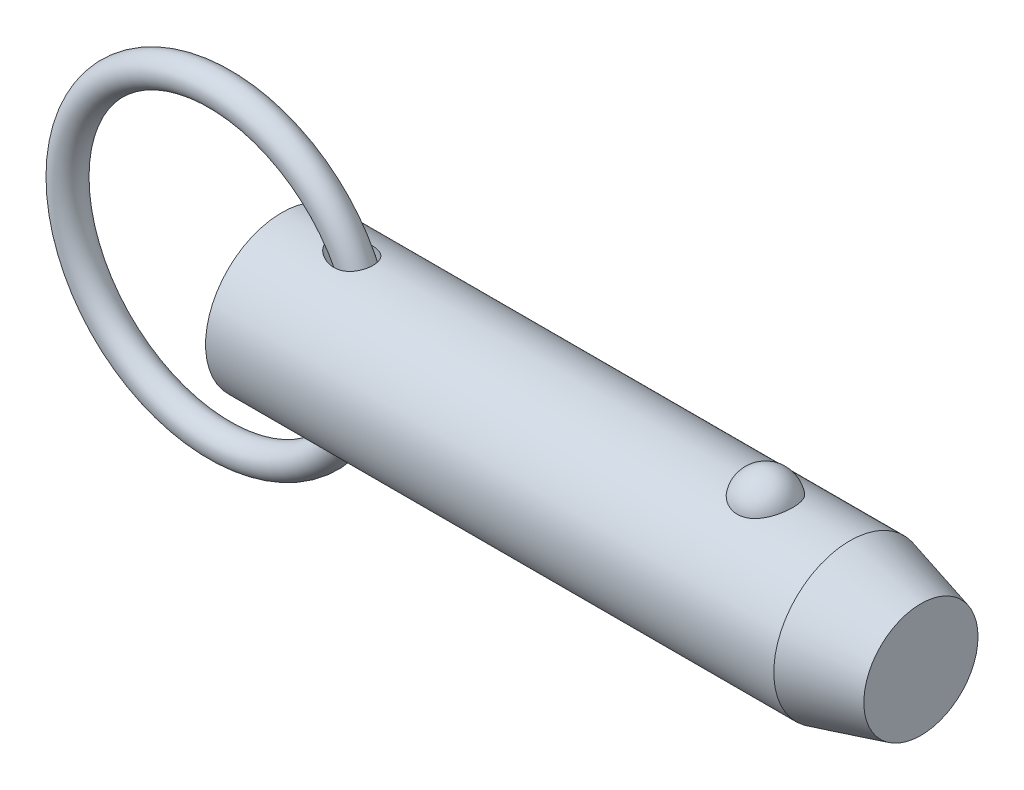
ISO-10303-21;
HEADER;
FILE_DESCRIPTION(('STEP AP214'),'2;1');
FILE_NAME('part.step','',(''),(''),'','','');
FILE_SCHEMA(('AUTOMOTIVE_DESIGN { 1 0 10303 214 1 1 1 1 }'));
ENDSEC;
DATA;
#1=APPLICATION_CONTEXT('core data for automotive mechanical design processes');
#2=APPLICATION_PROTOCOL_DEFINITION('international standard','automotive_design',2000,#1);
#3=PRODUCT_CONTEXT('',#1,'mechanical');
#4=PRODUCT('Part','Part','',(#3));
#5=PRODUCT_RELATED_PRODUCT_CATEGORY('part','',(#4));
#6=PRODUCT_DEFINITION_FORMATION('','',#4);
#7=PRODUCT_DEFINITION_CONTEXT('part definition',#1,'design');
#8=PRODUCT_DEFINITION('design','',#6,#7);
#9=PRODUCT_DEFINITION_SHAPE('','',#8);
#10=(LENGTH_UNIT() NAMED_UNIT(*) SI_UNIT(.MILLI.,.METRE.));
#11=(NAMED_UNIT(*) PLANE_ANGLE_UNIT() SI_UNIT($,.RADIAN.));
#12=(NAMED_UNIT(*) SI_UNIT($,.STERADIAN.) SOLID_ANGLE_UNIT());
#13=UNCERTAINTY_MEASURE_WITH_UNIT(LENGTH_MEASURE(1.E-05),#10,'distance_accuracy_value','');
#14=(GEOMETRIC_REPRESENTATION_CONTEXT(3) GLOBAL_UNCERTAINTY_ASSIGNED_CONTEXT((#13)) GLOBAL_UNIT_ASSIGNED_CONTEXT((#10,
#11,#12)) REPRESENTATION_CONTEXT('',''));
#15=CARTESIAN_POINT('',(0.,0.,0.));
#16=DIRECTION('',(0.,0.,1.));
#17=DIRECTION('',(1.,0.,0.));
#18=AXIS2_PLACEMENT_3D('',#15,#16,#17);
#19=CARTESIAN_POINT('',(-6.46799987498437,0.,0.));
#20=DIRECTION('',(0.,0.,1.));
#21=DIRECTION('',(1.,0.,0.));
#22=AXIS2_PLACEMENT_3D('',#19,#20,#21);
#23=TOROIDAL_SURFACE('',#22,15.875,1.588);
#24=CARTESIAN_POINT('',(10.9950001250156,0.,0.));
#25=VERTEX_POINT('',#24);
#26=VERTEX_LOOP('',#25);
#27=FACE_BOUND('',#26,.T.);
#28=ADVANCED_FACE('P0_F12',(#27),#23,.T.);
#29=CLOSED_SHELL('',(#28));
#30=MANIFOLD_SOLID_BREP('P0_B1',#29);
#31=CARTESIAN_POINT('',(0.,0.,0.));
#32=DIRECTION('',(1.,0.,0.));
#33=DIRECTION('',(0.,0.,-1.));
#34=AXIS2_PLACEMENT_3D('',#31,#32,#33);
#35=CYLINDRICAL_SURFACE('',#34,7.94);
#36=CARTESIAN_POINT('',(4.99454278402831,7.92831028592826,-0.430692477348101));
#37=CARTESIAN_POINT('',(5.02621962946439,7.92271974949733,-0.533554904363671));
#38=CARTESIAN_POINT('',(5.06869972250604,7.91528872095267,-0.633052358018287));
#39=CARTESIAN_POINT('',(5.17094751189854,7.89785690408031,-0.822566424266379));
#40=CARTESIAN_POINT('',(5.23077290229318,7.88784755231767,-0.912550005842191));
#41=CARTESIAN_POINT('',(5.37866013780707,7.8639674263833,-1.10117829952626));
#42=CARTESIAN_POINT('',(5.47004908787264,7.84973599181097,-1.19714712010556));
#43=CARTESIAN_POINT('',(5.66695490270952,7.82090787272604,-1.37293476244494));
#44=CARTESIAN_POINT('',(5.77247743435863,7.80631104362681,-1.45274707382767));
#45=CARTESIAN_POINT('',(5.99604254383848,7.77793596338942,-1.59776875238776));
#46=CARTESIAN_POINT('',(6.11428384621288,7.76417836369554,-1.66267404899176));
#47=CARTESIAN_POINT('',(6.35882685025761,7.73912410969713,-1.77564129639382));
#48=CARTESIAN_POINT('',(6.48513256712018,7.72782869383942,-1.82369477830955));
#49=CARTESIAN_POINT('',(6.76898453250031,7.70705630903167,-1.90977520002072));
#50=CARTESIAN_POINT('',(6.92778004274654,7.69837706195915,-1.94395681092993));
#51=CARTESIAN_POINT('',(7.24915504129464,7.6881294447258,-1.98412381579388));
#52=CARTESIAN_POINT('',(7.41173039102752,7.68655363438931,-1.99013871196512));
#53=CARTESIAN_POINT('',(7.697714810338,7.69094561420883,-1.97306069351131));
#54=CARTESIAN_POINT('',(7.82153338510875,7.69526202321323,-1.95634328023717));
#55=CARTESIAN_POINT('',(8.06460511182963,7.70859273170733,-1.90314615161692));
#56=CARTESIAN_POINT('',(8.18386164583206,7.7176034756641,-1.86668139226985));
#57=CARTESIAN_POINT('',(8.41450663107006,7.73959050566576,-1.77331230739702));
#58=CARTESIAN_POINT('',(8.52585042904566,7.75258738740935,-1.71630154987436));
#59=CARTESIAN_POINT('',(8.73575290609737,7.7809705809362,-1.58263416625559));
#60=CARTESIAN_POINT('',(8.8343144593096,7.7963563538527,-1.50598196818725));
#61=CARTESIAN_POINT('',(9.00639839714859,7.8259635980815,-1.34315626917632));
#62=CARTESIAN_POINT('',(9.08139772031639,7.84016008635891,-1.25853389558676));
#63=CARTESIAN_POINT('',(9.21545590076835,7.86710959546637,-1.07729126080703));
#64=CARTESIAN_POINT('',(9.27451869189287,7.87986297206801,-0.980673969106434));
#65=CARTESIAN_POINT('',(9.37315031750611,7.90198817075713,-0.782161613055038));
#66=CARTESIAN_POINT('',(9.41336512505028,7.91146854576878,-0.68059867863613));
#67=CARTESIAN_POINT('',(9.47650914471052,7.92664976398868,-0.471967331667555));
#68=CARTESIAN_POINT('',(9.49943917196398,7.93235078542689,-0.364899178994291));
#69=CARTESIAN_POINT('',(9.52744661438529,7.93934369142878,-0.14863226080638));
#70=CARTESIAN_POINT('',(9.53257574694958,7.9406483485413,-0.0394405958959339));
#71=CARTESIAN_POINT('',(9.52501411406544,7.93874464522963,0.178286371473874));
#72=CARTESIAN_POINT('',(9.51232314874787,7.93553623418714,0.286821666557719));
#73=CARTESIAN_POINT('',(9.46937875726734,7.92494527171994,0.500278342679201));
#74=CARTESIAN_POINT('',(9.43910562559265,7.9175580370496,0.605195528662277));
#75=CARTESIAN_POINT('',(9.36168926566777,7.8994090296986,0.808294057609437));
#76=CARTESIAN_POINT('',(9.31454677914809,7.88864740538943,0.906475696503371));
#77=CARTESIAN_POINT('',(9.20464679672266,7.86494645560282,1.09319438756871));
#78=CARTESIAN_POINT('',(9.14191093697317,7.85201015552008,1.18174456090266));
#79=CARTESIAN_POINT('',(9.00249124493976,7.82536913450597,1.34692675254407));
#80=CARTESIAN_POINT('',(8.92580850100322,7.81166447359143,1.42355969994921));
#81=CARTESIAN_POINT('',(8.76033130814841,7.78490157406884,1.56333296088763));
#82=CARTESIAN_POINT('',(8.67148512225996,7.77184644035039,1.62641250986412));
#83=CARTESIAN_POINT('',(8.48457694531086,7.74778101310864,1.73744892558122));
#84=CARTESIAN_POINT('',(8.3865141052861,7.73677090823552,1.78540439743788));
#85=CARTESIAN_POINT('',(8.18013312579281,7.71742695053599,1.86728938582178));
#86=CARTESIAN_POINT('',(8.07156725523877,7.7092102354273,1.90061897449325));
#87=CARTESIAN_POINT('',(7.85050876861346,7.6966502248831,1.95085652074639));
#88=CARTESIAN_POINT('',(7.73801453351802,7.69230854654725,1.967757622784));
#89=CARTESIAN_POINT('',(7.50002163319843,7.6873799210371,1.98693391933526));
#90=CARTESIAN_POINT('',(7.37438052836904,7.68722739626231,1.98751701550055));
#91=CARTESIAN_POINT('',(7.12435864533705,7.69142268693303,1.97121025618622));
#92=CARTESIAN_POINT('',(6.99997834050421,7.6957721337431,1.9543140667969));
#93=CARTESIAN_POINT('',(6.73521978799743,7.70925573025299,1.90049277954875));
#94=CARTESIAN_POINT('',(6.59543541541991,7.71903968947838,1.86081454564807));
#95=CARTESIAN_POINT('',(6.32319848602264,7.74233460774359,1.76138158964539));
#96=CARTESIAN_POINT('',(6.19076082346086,7.75585282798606,1.7015877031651));
#97=CARTESIAN_POINT('',(5.99269110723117,7.7785835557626,1.59336057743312));
#98=CARTESIAN_POINT('',(5.92332049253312,7.78707101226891,1.55151799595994));
#99=CARTESIAN_POINT('',(5.78862576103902,7.80440479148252,1.46183267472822));
#100=CARTESIAN_POINT('',(5.72330291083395,7.81325122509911,1.41398807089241));
#101=CARTESIAN_POINT('',(5.53492618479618,7.83980388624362,1.26162857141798));
#102=CARTESIAN_POINT('',(5.41884115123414,7.85759887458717,1.14795556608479));
#103=CARTESIAN_POINT('',(5.25731156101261,7.88350844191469,0.948390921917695));
#104=CARTESIAN_POINT('',(5.20241173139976,7.89260196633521,0.87019982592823));
#105=CARTESIAN_POINT('',(5.10541071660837,7.90897737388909,0.70602680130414));
#106=CARTESIAN_POINT('',(5.06329682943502,7.91626105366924,0.620052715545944));
#107=CARTESIAN_POINT('',(4.99458837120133,7.92827352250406,0.440665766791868));
#108=CARTESIAN_POINT('',(4.96816655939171,7.93297382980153,0.347182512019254));
#109=CARTESIAN_POINT('',(4.94275291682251,7.93751024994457,0.204498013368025));
#110=CARTESIAN_POINT('',(4.93665149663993,7.9386033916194,0.156529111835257));
#111=CARTESIAN_POINT('',(4.92932198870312,7.93991739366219,0.0602142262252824));
#112=CARTESIAN_POINT('',(4.9280924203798,7.94013851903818,0.011868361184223));
#113=CARTESIAN_POINT('',(4.93104052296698,7.93960920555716,-0.103241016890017));
#114=CARTESIAN_POINT('',(4.93747289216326,7.93845361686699,-0.169956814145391));
#115=CARTESIAN_POINT('',(4.95939910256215,7.93453812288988,-0.301777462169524));
#116=CARTESIAN_POINT('',(4.97489225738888,7.9317783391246,-0.36688243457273));
#117=CARTESIAN_POINT('',(4.99454278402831,7.92831028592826,-0.430692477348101));
#118=B_SPLINE_CURVE_WITH_KNOTS('',3,(#36,#37,#38,#39,#40,#41,#42,#43,#44,#45,#46,#47,#48,#49,
#50,#51,#52,#53,#54,#55,#56,#57,#58,#59,#60,#61,#62,#63,#64,#65,#66,#67,#68,#69,#70,#71,#72,#73,
#74,#75,#76,#77,#78,#79,#80,#81,#82,#83,#84,#85,#86,#87,#88,#89,#90,#91,#92,#93,#94,#95,#96,#97,
#98,#99,#100,#101,#102,#103,#104,#105,#106,#107,#108,#109,#110,#111,#112,#113,#114,#115,#116,
#117),.UNSPECIFIED.,.T.,.F.,(4,2,2,2,2,2,2,2,2,2,2,2,2,2,2,2,2,2,2,2,2,2,2,2,2,2,2,2,2,2,2,2,2,
2,2,2,2,2,2,2,4),(0.,0.323000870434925,0.647088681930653,1.04479679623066,1.4426648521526,
1.84804279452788,2.25362416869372,2.73917777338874,3.2242226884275,3.59772765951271,
3.97095014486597,4.34613445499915,4.72123425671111,5.06140749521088,5.40149668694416,
5.72887751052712,6.05624289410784,6.38265637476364,6.70907351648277,7.03585720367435,
7.36262652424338,7.68894495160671,8.01523792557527,8.34296459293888,8.67072147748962,
9.01089033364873,9.35120108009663,9.72668268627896,10.1023004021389,10.5375309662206,
10.9736138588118,11.2176803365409,11.461822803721,11.9480055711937,12.2349837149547,
12.5216758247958,12.8114683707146,12.9563497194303,13.1011870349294,13.3015737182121,
13.5019452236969),.UNSPECIFIED.);
#119=CARTESIAN_POINT('',(4.99454278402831,7.92831028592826,-0.430692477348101));
#120=VERTEX_POINT('',#119);
#121=EDGE_CURVE('P1_E40',#120,#120,#118,.T.);
#122=ORIENTED_EDGE('',*,*,#121,.T.);
#123=EDGE_LOOP('',(#122));
#124=FACE_BOUND('',#123,.T.);
#125=CARTESIAN_POINT('',(59.2718791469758,0.,0.));
#126=DIRECTION('',(1.,0.,0.));
#127=DIRECTION('',(0.,0.,-1.));
#128=AXIS2_PLACEMENT_3D('',#125,#126,#127);
#129=CIRCLE('',#128,7.94);
#130=CARTESIAN_POINT('',(59.2718791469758,0.,-7.94));
#131=VERTEX_POINT('',#130);
#132=EDGE_CURVE('P1_E25',#131,#131,#129,.T.);
#133=ORIENTED_EDGE('',*,*,#132,.F.);
#134=EDGE_LOOP('',(#133));
#135=FACE_BOUND('',#134,.T.);
#136=CARTESIAN_POINT('',(0.,0.,0.));
#137=DIRECTION('',(1.,0.,0.));
#138=DIRECTION('',(0.,0.,-1.));
#139=AXIS2_PLACEMENT_3D('',#136,#137,#138);
#140=CIRCLE('',#139,7.94);
#141=CARTESIAN_POINT('',(0.,0.,-7.94));
#142=VERTEX_POINT('',#141);
#143=EDGE_CURVE('P1_E9',#142,#142,#140,.T.);
#144=ORIENTED_EDGE('',*,*,#143,.T.);
#145=EDGE_LOOP('',(#144));
#146=FACE_BOUND('',#145,.T.);
#147=CARTESIAN_POINT('',(50.4649074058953,7.37767842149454,2.93486986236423));
#148=CARTESIAN_POINT('',(50.3127496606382,7.3776732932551,2.93487505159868));
#149=CARTESIAN_POINT('',(50.1606329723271,7.38258419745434,2.92262454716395));
#150=CARTESIAN_POINT('',(49.8609284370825,7.40163229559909,2.87404196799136));
#151=CARTESIAN_POINT('',(49.7133394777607,7.41576720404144,2.83771585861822));
#152=CARTESIAN_POINT('',(49.4270187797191,7.4516157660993,2.74218769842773));
#153=CARTESIAN_POINT('',(49.2882745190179,7.47331841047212,2.68301886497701));
#154=CARTESIAN_POINT('',(49.0228822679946,7.52194082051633,2.54350967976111));
#155=CARTESIAN_POINT('',(48.8962366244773,7.5488615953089,2.46316523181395));
#156=CARTESIAN_POINT('',(48.6545349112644,7.60594671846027,2.2809037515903));
#157=CARTESIAN_POINT('',(48.5399065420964,7.63618114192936,2.17844211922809));
#158=CARTESIAN_POINT('',(48.3288787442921,7.69614046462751,1.95608495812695));
#159=CARTESIAN_POINT('',(48.2324826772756,7.72586526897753,1.83618622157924));
#160=CARTESIAN_POINT('',(48.0559381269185,7.78314821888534,1.57628086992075));
#161=CARTESIAN_POINT('',(47.9767072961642,7.81055035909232,1.43561546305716));
#162=CARTESIAN_POINT('',(47.8417979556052,7.85879631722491,1.14236334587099));
#163=CARTESIAN_POINT('',(47.7861216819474,7.87963951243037,0.989775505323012));
#164=CARTESIAN_POINT('',(47.6988121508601,7.91289645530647,0.674619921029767));
#165=CARTESIAN_POINT('',(47.6675309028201,7.925186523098,0.511941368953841));
#166=CARTESIAN_POINT('',(47.630975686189,7.93958930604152,0.183247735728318));
#167=CARTESIAN_POINT('',(47.6257012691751,7.94170219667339,0.017232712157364));
#168=CARTESIAN_POINT('',(47.6412311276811,7.93554931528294,-0.31267286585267));
#169=CARTESIAN_POINT('',(47.6619253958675,7.92732732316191,-0.476569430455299));
#170=CARTESIAN_POINT('',(47.7287865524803,7.90141534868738,-0.79830524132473));
#171=CARTESIAN_POINT('',(47.7749539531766,7.88372517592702,-0.956144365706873));
#172=CARTESIAN_POINT('',(47.8918986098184,7.84066230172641,-1.26152073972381));
#173=CARTESIAN_POINT('',(47.9627046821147,7.81528060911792,-1.40904568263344));
#174=CARTESIAN_POINT('',(48.1274789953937,7.7594867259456,-1.68950598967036));
#175=CARTESIAN_POINT('',(48.2214488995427,7.72907417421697,-1.82244030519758));
#176=CARTESIAN_POINT('',(48.4308391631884,7.66640424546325,-2.07032792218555));
#177=CARTESIAN_POINT('',(48.5463152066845,7.63414223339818,-2.1852330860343));
#178=CARTESIAN_POINT('',(48.7959006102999,7.57149681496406,-2.39329737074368));
#179=CARTESIAN_POINT('',(48.9300080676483,7.54111321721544,-2.48645870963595));
#180=CARTESIAN_POINT('',(49.2101113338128,7.48650742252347,-2.64628132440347));
#181=CARTESIAN_POINT('',(49.3557605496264,7.46215900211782,-2.71350554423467));
#182=CARTESIAN_POINT('',(49.6574259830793,7.42171253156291,-2.82226614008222));
#183=CARTESIAN_POINT('',(49.8134383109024,7.40561140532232,-2.86381209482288));
#184=CARTESIAN_POINT('',(50.1229708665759,7.3842679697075,-2.9183907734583));
#185=CARTESIAN_POINT('',(50.2762229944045,7.37852109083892,-2.93275024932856));
#186=CARTESIAN_POINT('',(50.5830705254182,7.37700973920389,-2.93655208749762));
#187=CARTESIAN_POINT('',(50.7366658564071,7.38124333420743,-2.92599927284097));
#188=CARTESIAN_POINT('',(51.0349907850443,7.39890635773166,-2.88102897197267));
#189=CARTESIAN_POINT('',(51.1798480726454,7.41205491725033,-2.8473399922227));
#190=CARTESIAN_POINT('',(51.4616432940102,7.445801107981,-2.75788206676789));
#191=CARTESIAN_POINT('',(51.5985805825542,7.46639934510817,-2.70211132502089));
#192=CARTESIAN_POINT('',(51.8640619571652,7.51339098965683,-2.56858908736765));
#193=CARTESIAN_POINT('',(51.9923548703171,7.53990200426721,-2.49038067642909));
#194=CARTESIAN_POINT('',(52.2342440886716,7.59569503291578,-2.31462737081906));
#195=CARTESIAN_POINT('',(52.3478370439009,7.62497767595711,-2.21707808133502));
#196=CARTESIAN_POINT('',(52.56322156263,7.68489473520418,-1.99982049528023));
#197=CARTESIAN_POINT('',(52.6641488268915,7.71552419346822,-1.87925337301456));
#198=CARTESIAN_POINT('',(52.8451866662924,7.77353016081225,-1.62268826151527));
#199=CARTESIAN_POINT('',(52.9252934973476,7.80090608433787,-1.4866875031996));
#200=CARTESIAN_POINT('',(53.0653615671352,7.85047992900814,-1.19818413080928));
#201=CARTESIAN_POINT('',(53.1245877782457,7.8724818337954,-1.04529016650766));
#202=CARTESIAN_POINT('',(53.2179821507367,7.90785114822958,-0.731080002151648));
#203=CARTESIAN_POINT('',(53.2521497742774,7.92121837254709,-0.569763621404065));
#204=CARTESIAN_POINT('',(53.294795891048,7.93797834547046,-0.242812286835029));
#205=CARTESIAN_POINT('',(53.3032047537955,7.94134405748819,-0.0771668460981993));
#206=CARTESIAN_POINT('',(53.2939626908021,7.93767937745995,0.253276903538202));
#207=CARTESIAN_POINT('',(53.2763120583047,7.93064910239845,0.418075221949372));
#208=CARTESIAN_POINT('',(53.2154247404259,7.90695571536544,0.741525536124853));
#209=CARTESIAN_POINT('',(53.1722819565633,7.8903279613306,0.90019782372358));
#210=CARTESIAN_POINT('',(53.0613535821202,7.84916386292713,1.20759654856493));
#211=CARTESIAN_POINT('',(52.99356656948,7.82462706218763,1.35632241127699));
#212=CARTESIAN_POINT('',(52.8343718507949,7.7700669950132,1.64032869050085));
#213=CARTESIAN_POINT('',(52.7428616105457,7.7400200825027,1.77554712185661));
#214=CARTESIAN_POINT('',(52.5382960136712,7.67774175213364,2.02800648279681));
#215=CARTESIAN_POINT('',(52.4252410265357,7.64551037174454,2.14524772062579));
#216=CARTESIAN_POINT('',(52.1808318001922,7.58265895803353,2.35778002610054));
#217=CARTESIAN_POINT('',(52.0495833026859,7.5520309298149,2.45319004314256));
#218=CARTESIAN_POINT('',(51.771601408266,7.49579792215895,2.61999897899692));
#219=CARTESIAN_POINT('',(51.6248670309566,7.47019326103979,2.69139637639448));
#220=CARTESIAN_POINT('',(51.3129477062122,7.42622216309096,2.8105324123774));
#221=CARTESIAN_POINT('',(51.1472209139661,7.40825002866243,2.85700910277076));
#222=CARTESIAN_POINT('',(50.8092792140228,7.38398348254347,2.9191685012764));
#223=CARTESIAN_POINT('',(50.6370670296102,7.3776842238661,2.93486399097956));
#224=CARTESIAN_POINT('',(50.4649074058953,7.37767842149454,2.93486986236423));
#225=B_SPLINE_CURVE_WITH_KNOTS('',3,(#147,#148,#149,#150,#151,#152,#153,#154,#155,#156,#157,
#158,#159,#160,#161,#162,#163,#164,#165,#166,#167,#168,#169,#170,#171,#172,#173,#174,#175,#176,
#177,#178,#179,#180,#181,#182,#183,#184,#185,#186,#187,#188,#189,#190,#191,#192,#193,#194,#195,
#196,#197,#198,#199,#200,#201,#202,#203,#204,#205,#206,#207,#208,#209,#210,#211,#212,#213,#214,
#215,#216,#217,#218,#219,#220,#221,#222,#223,#224),.UNSPECIFIED.,.T.,.F.,(4,2,2,2,2,2,2,2,2,2,2,
2,2,2,2,2,2,2,2,2,2,2,2,2,2,2,2,2,2,2,2,2,2,2,2,2,2,2,4),(0.,0.45584132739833,0.911569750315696,
1.36663794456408,1.82179423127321,2.28978983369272,2.7578716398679,3.246853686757,
3.73588214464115,4.23184282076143,4.72779494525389,5.22165321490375,5.71552141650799,
6.20996917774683,6.70445245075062,7.20023431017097,7.69596557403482,8.18023418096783,
8.66432203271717,9.12410697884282,9.58380291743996,10.0296503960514,10.4755341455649,
10.9312349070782,11.3870393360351,11.8654416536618,12.3439299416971,12.8378875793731,
13.3318558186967,13.8271581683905,14.3224549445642,14.8159385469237,15.3094506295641,
15.8051323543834,16.3008055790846,16.7937101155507,17.2866458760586,17.8026240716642,
18.3183879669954),.UNSPECIFIED.);
#226=CARTESIAN_POINT('',(50.4649074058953,7.37767842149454,2.93486986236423));
#227=VERTEX_POINT('',#226);
#228=EDGE_CURVE('P1_E34',#227,#227,#225,.T.);
#229=ORIENTED_EDGE('',*,*,#228,.T.);
#230=EDGE_LOOP('',(#229));
#231=FACE_BOUND('',#230,.T.);
#232=CARTESIAN_POINT('',(4.99454278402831,-7.92831028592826,-0.430692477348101));
#233=CARTESIAN_POINT('',(4.97033227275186,-7.93258231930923,-0.352006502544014));
#234=CARTESIAN_POINT('',(4.95238785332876,-7.93578782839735,-0.271213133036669));
#235=CARTESIAN_POINT('',(4.93055628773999,-7.93969351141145,-0.107590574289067));
#236=CARTESIAN_POINT('',(4.92668686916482,-7.9403905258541,-0.0247589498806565));
#237=CARTESIAN_POINT('',(4.93338086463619,-7.93918950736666,0.140249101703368));
#238=CARTESIAN_POINT('',(4.94393526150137,-7.93729309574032,0.222425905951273));
#239=CARTESIAN_POINT('',(4.97854187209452,-7.93113325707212,0.383746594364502));
#240=CARTESIAN_POINT('',(5.00259804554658,-7.92686913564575,0.462889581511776));
#241=CARTESIAN_POINT('',(5.06904511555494,-7.91526143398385,0.633278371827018));
#242=CARTESIAN_POINT('',(5.11430124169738,-7.90744739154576,0.723368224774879));
#243=CARTESIAN_POINT('',(5.21873327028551,-7.88988375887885,0.894880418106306));
#244=CARTESIAN_POINT('',(5.27793532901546,-7.88013053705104,0.976286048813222));
#245=CARTESIAN_POINT('',(5.42949971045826,-7.85602233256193,1.15646341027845));
#246=CARTESIAN_POINT('',(5.52624420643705,-7.84124381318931,1.25147911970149));
#247=CARTESIAN_POINT('',(5.73364751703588,-7.81163164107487,1.42469165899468));
#248=CARTESIAN_POINT('',(5.84432059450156,-7.79679794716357,1.50287102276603));
#249=CARTESIAN_POINT('',(6.07871104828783,-7.76824211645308,1.64418004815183));
#250=CARTESIAN_POINT('',(6.20267992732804,-7.75455572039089,1.70689813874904));
#251=CARTESIAN_POINT('',(6.45850163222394,-7.73013259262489,1.81429879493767));
#252=CARTESIAN_POINT('',(6.5903577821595,-7.71939711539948,1.85897369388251));
#253=CARTESIAN_POINT('',(6.88209177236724,-7.70072462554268,1.93500734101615));
#254=CARTESIAN_POINT('',(7.04295460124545,-7.69356120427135,1.96286607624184));
#255=CARTESIAN_POINT('',(7.36724421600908,-7.68676336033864,1.98935053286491));
#256=CARTESIAN_POINT('',(7.53066723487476,-7.68711875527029,1.98801578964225));
#257=CARTESIAN_POINT('',(7.81370255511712,-7.69496475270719,1.95735673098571));
#258=CARTESIAN_POINT('',(7.93413357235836,-7.70066491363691,1.93505220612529));
#259=CARTESIAN_POINT('',(8.1695059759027,-7.71642704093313,1.87121573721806));
#260=CARTESIAN_POINT('',(8.28445128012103,-7.72648584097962,1.82969774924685));
#261=CARTESIAN_POINT('',(8.50557964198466,-7.75006886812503,1.72707806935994));
#262=CARTESIAN_POINT('',(8.61171927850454,-7.76360905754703,1.66588583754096));
#263=CARTESIAN_POINT('',(8.810712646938,-7.79249659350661,1.52503518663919));
#264=CARTESIAN_POINT('',(8.9035682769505,-7.80784368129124,1.44537941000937));
#265=CARTESIAN_POINT('',(9.06550151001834,-7.83702302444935,1.27723027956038));
#266=CARTESIAN_POINT('',(9.13591399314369,-7.85087516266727,1.19002179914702));
#267=CARTESIAN_POINT('',(9.26060432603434,-7.87675706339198,1.00451336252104));
#268=CARTESIAN_POINT('',(9.31488561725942,-7.88878721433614,0.906215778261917));
#269=CARTESIAN_POINT('',(9.40446618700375,-7.90930761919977,0.70456335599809));
#270=CARTESIAN_POINT('',(9.44028687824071,-7.91789338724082,0.601449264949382));
#271=CARTESIAN_POINT('',(9.49451523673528,-7.93109531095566,0.390496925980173));
#272=CARTESIAN_POINT('',(9.5129234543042,-7.93571159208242,0.282658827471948));
#273=CARTESIAN_POINT('',(9.53189686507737,-7.94047189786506,0.0654759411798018));
#274=CARTESIAN_POINT('',(9.53248611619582,-7.94062195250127,-0.0438666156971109));
#275=CARTESIAN_POINT('',(9.51587068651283,-7.93644929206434,-0.26110665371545));
#276=CARTESIAN_POINT('',(9.49866585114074,-7.93212653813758,-0.369004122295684));
#277=CARTESIAN_POINT('',(9.44682594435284,-7.91946859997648,-0.58038072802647));
#278=CARTESIAN_POINT('',(9.41217614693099,-7.91113002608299,-0.683856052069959));
#279=CARTESIAN_POINT('',(9.32626198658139,-7.89134774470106,-0.883337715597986));
#280=CARTESIAN_POINT('',(9.27499851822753,-7.87990420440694,-0.979344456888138));
#281=CARTESIAN_POINT('',(9.15725058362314,-7.8551872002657,-1.1610523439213));
#282=CARTESIAN_POINT('',(9.09078836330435,-7.84191642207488,-1.24676827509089));
#283=CARTESIAN_POINT('',(8.94443523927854,-7.81498501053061,-1.40574704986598));
#284=CARTESIAN_POINT('',(8.86454527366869,-7.80132440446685,-1.47901076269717));
#285=CARTESIAN_POINT('',(8.69307774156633,-7.77497848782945,-1.61181253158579));
#286=CARTESIAN_POINT('',(8.60142539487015,-7.76230033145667,-1.67125525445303));
#287=CARTESIAN_POINT('',(8.40957687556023,-7.73928987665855,-1.77477159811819));
#288=CARTESIAN_POINT('',(8.30937953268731,-7.72895790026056,-1.81884310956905));
#289=CARTESIAN_POINT('',(8.0986350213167,-7.71113842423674,-1.89300673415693));
#290=CARTESIAN_POINT('',(7.98782526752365,-7.70379913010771,-1.92238394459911));
#291=CARTESIAN_POINT('',(7.76294389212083,-7.69313871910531,-1.96460780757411));
#292=CARTESIAN_POINT('',(7.64887102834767,-7.68981915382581,-1.9774480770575));
#293=CARTESIAN_POINT('',(7.40716929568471,-7.68706358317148,-1.98813881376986));
#294=CARTESIAN_POINT('',(7.27945620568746,-7.68810537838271,-1.98414471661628));
#295=CARTESIAN_POINT('',(7.0259394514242,-7.6946815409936,-1.95847707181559));
#296=CARTESIAN_POINT('',(6.90013720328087,-7.7002190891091,-1.93679100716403));
#297=CARTESIAN_POINT('',(6.63265145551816,-7.71617635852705,-1.87230070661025));
#298=CARTESIAN_POINT('',(6.49169161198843,-7.72724102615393,-1.82664736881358));
#299=CARTESIAN_POINT('',(6.21840602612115,-7.75282261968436,-1.71482542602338));
#300=CARTESIAN_POINT('',(6.08608498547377,-7.76734140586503,-1.64864576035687));
#301=CARTESIAN_POINT('',(5.84453114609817,-7.7967744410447,-1.50297952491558));
#302=CARTESIAN_POINT('',(5.73429128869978,-7.81154606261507,-1.4251373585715));
#303=CARTESIAN_POINT('',(5.52761180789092,-7.84104229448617,-1.25271210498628));
#304=CARTESIAN_POINT('',(5.4311600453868,-7.85576693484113,-1.15814390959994));
#305=CARTESIAN_POINT('',(5.27970568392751,-7.87984260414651,-0.978603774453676));
#306=CARTESIAN_POINT('',(5.22040249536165,-7.88960721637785,-0.897319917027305));
#307=CARTESIAN_POINT('',(5.11583115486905,-7.90718602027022,-0.726171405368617));
#308=CARTESIAN_POINT('',(5.07050564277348,-7.9150081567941,-0.636343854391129));
#309=CARTESIAN_POINT('',(5.01937588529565,-7.92393751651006,-0.506165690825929));
#310=CARTESIAN_POINT('',(5.00622932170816,-7.926248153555,-0.468674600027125));
#311=CARTESIAN_POINT('',(4.99454278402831,-7.92831028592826,-0.430692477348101));
#312=B_SPLINE_CURVE_WITH_KNOTS('',3,(#232,#233,#234,#235,#236,#237,#238,#239,#240,#241,#242,
#243,#244,#245,#246,#247,#248,#249,#250,#251,#252,#253,#254,#255,#256,#257,#258,#259,#260,#261,
#262,#263,#264,#265,#266,#267,#268,#269,#270,#271,#272,#273,#274,#275,#276,#277,#278,#279,#280,
#281,#282,#283,#284,#285,#286,#287,#288,#289,#290,#291,#292,#293,#294,#295,#296,#297,#298,#299,
#300,#301,#302,#303,#304,#305,#306,#307,#308,#309,#310,#311),.UNSPECIFIED.,.T.,.F.,(4,2,2,2,2,2,
2,2,2,2,2,2,2,2,2,2,2,2,2,2,2,2,2,2,2,2,2,2,2,2,2,2,2,2,2,2,2,2,2,4),(0.,0.247186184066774,
0.494683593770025,0.742026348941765,0.989441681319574,1.29115800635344,1.59344478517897,
2.00047108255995,2.40791761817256,2.82525860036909,3.2427767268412,3.7304673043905,
4.21749746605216,4.58380730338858,4.94985148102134,5.31760488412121,5.68530568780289,
6.02244390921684,6.35951015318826,6.68644714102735,7.01337379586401,7.33985903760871,
7.66634711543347,7.9931112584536,8.31985780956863,8.64612913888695,8.97237768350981,
9.30081392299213,9.62929521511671,9.9724956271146,10.3158284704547,10.6977037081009,
11.0798493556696,11.523823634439,11.9680375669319,12.3738595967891,12.7793221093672,
13.0815405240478,13.3825016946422,13.5018197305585),.UNSPECIFIED.);
#313=CARTESIAN_POINT('',(4.99454278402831,-7.92831028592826,-0.430692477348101));
#314=VERTEX_POINT('',#313);
#315=EDGE_CURVE('P1_E17',#314,#314,#312,.T.);
#316=ORIENTED_EDGE('',*,*,#315,.T.);
#317=EDGE_LOOP('',(#316));
#318=FACE_BOUND('',#317,.T.);
#319=ADVANCED_FACE('P1_F13',(#124,#135,#146,#231,#318),#35,.T.);
#320=CARTESIAN_POINT('',(0.,0.,0.));
#321=DIRECTION('',(-1.,0.,0.));
#322=DIRECTION('',(0.,0.,1.));
#323=AXIS2_PLACEMENT_3D('',#320,#321,#322);
#324=PLANE('',#323);
#325=ORIENTED_EDGE('',*,*,#143,.F.);
#326=EDGE_LOOP('',(#325));
#327=FACE_BOUND('',#326,.T.);
#328=ADVANCED_FACE('P1_F15',(#327),#324,.T.);
#329=CARTESIAN_POINT('',(66.68,0.,0.));
#330=DIRECTION('',(-1.,0.,0.));
#331=DIRECTION('',(0.,0.,1.));
#332=AXIS2_PLACEMENT_3D('',#329,#330,#331);
#333=CONICAL_SURFACE('',#332,5.95500000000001,0.26179938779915);
#334=ORIENTED_EDGE('',*,*,#132,.T.);
#335=EDGE_LOOP('',(#334));
#336=FACE_BOUND('',#335,.T.);
#337=CARTESIAN_POINT('',(66.68,0.,0.));
#338=DIRECTION('',(1.,0.,0.));
#339=DIRECTION('',(0.,0.,-1.));
#340=AXIS2_PLACEMENT_3D('',#337,#338,#339);
#341=CIRCLE('',#340,5.95500000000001);
#342=CARTESIAN_POINT('',(66.68,0.,-5.95500000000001));
#343=VERTEX_POINT('',#342);
#344=EDGE_CURVE('P1_E30',#343,#343,#341,.T.);
#345=ORIENTED_EDGE('',*,*,#344,.F.);
#346=EDGE_LOOP('',(#345));
#347=FACE_BOUND('',#346,.T.);
#348=ADVANCED_FACE('P1_F55',(#336,#347),#333,.T.);
#349=CARTESIAN_POINT('',(66.68,5.95500000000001,0.));
#350=DIRECTION('',(1.,0.,0.));
#351=DIRECTION('',(0.,0.,-1.));
#352=AXIS2_PLACEMENT_3D('',#349,#350,#351);
#353=PLANE('',#352);
#354=ORIENTED_EDGE('',*,*,#344,.T.);
#355=EDGE_LOOP('',(#354));
#356=FACE_BOUND('',#355,.T.);
#357=ADVANCED_FACE('P1_F51',(#356),#353,.T.);
#358=CARTESIAN_POINT('',(50.4649074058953,7.146,0.));
#359=DIRECTION('',(-1.,0.,0.));
#360=DIRECTION('',(0.,-1.,0.));
#361=AXIS2_PLACEMENT_3D('',#358,#359,#360);
#362=SPHERICAL_SURFACE('',#361,2.944);
#363=ORIENTED_EDGE('',*,*,#228,.F.);
#364=EDGE_LOOP('',(#363));
#365=FACE_BOUND('',#364,.T.);
#366=ADVANCED_FACE('P1_F46',(#365),#362,.T.);
#367=CARTESIAN_POINT('',(-6.46799987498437,0.,0.));
#368=DIRECTION('',(0.,0.,1.));
#369=DIRECTION('',(1.,0.,0.));
#370=AXIS2_PLACEMENT_3D('',#367,#368,#369);
#371=TOROIDAL_SURFACE('',#370,15.875,1.985);
#372=ORIENTED_EDGE('',*,*,#315,.F.);
#373=EDGE_LOOP('',(#372));
#374=FACE_BOUND('',#373,.T.);
#375=ORIENTED_EDGE('',*,*,#121,.F.);
#376=EDGE_LOOP('',(#375));
#377=FACE_BOUND('',#376,.T.);
#378=ADVANCED_FACE('P1_F50',(#374,#377),#371,.F.);
#379=CLOSED_SHELL('',(#319,#328,#348,#357,#366,#378));
#380=MANIFOLD_SOLID_BREP('P1_B1',#379);
#381=ADVANCED_BREP_SHAPE_REPRESENTATION('',(#18,#30,#380),#14);
#382=SHAPE_DEFINITION_REPRESENTATION(#9,#381);
ENDSEC;
END-ISO-10303-21;
